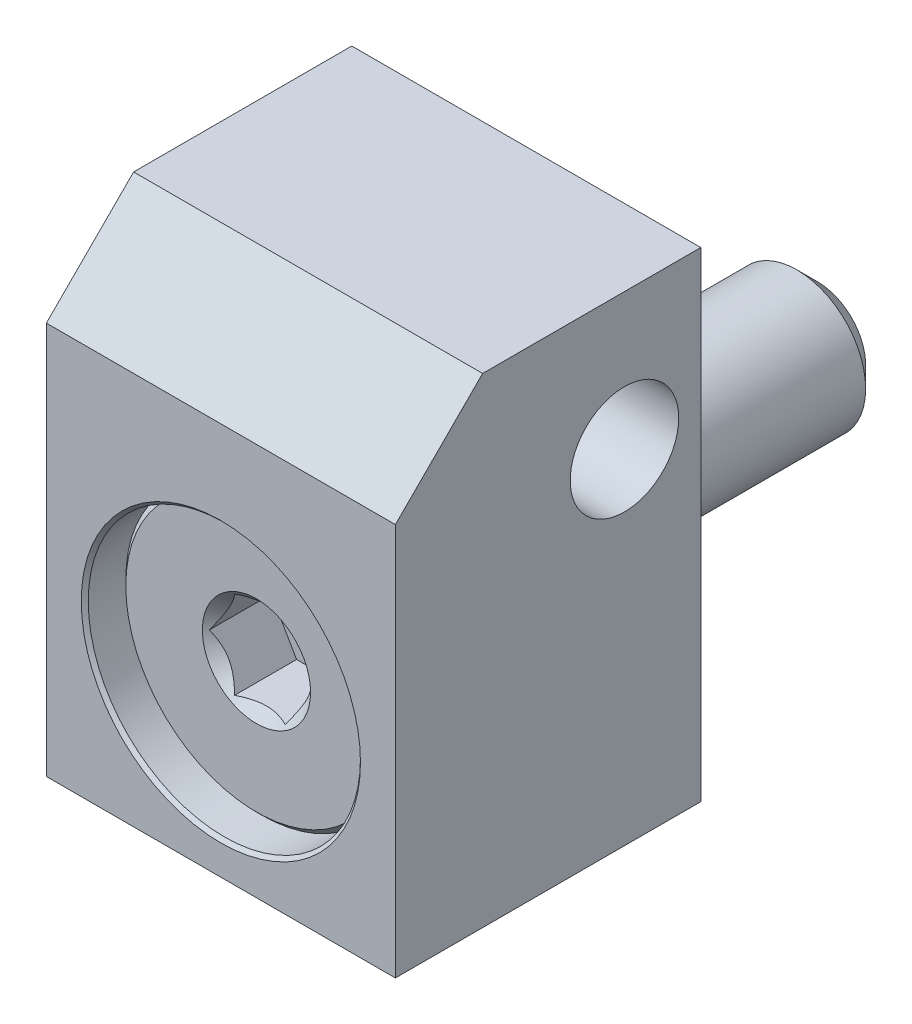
ISO-10303-21;
HEADER;
FILE_DESCRIPTION(('STEP AP214'),'2;1');
FILE_NAME('part.step','',(''),(''),'','','');
FILE_SCHEMA(('AUTOMOTIVE_DESIGN { 1 0 10303 214 1 1 1 1 }'));
ENDSEC;
DATA;
#1=APPLICATION_CONTEXT('core data for automotive mechanical design processes');
#2=APPLICATION_PROTOCOL_DEFINITION('international standard','automotive_design',2000,#1);
#3=PRODUCT_CONTEXT('',#1,'mechanical');
#4=PRODUCT('Part','Part','',(#3));
#5=PRODUCT_RELATED_PRODUCT_CATEGORY('part','',(#4));
#6=PRODUCT_DEFINITION_FORMATION('','',#4);
#7=PRODUCT_DEFINITION_CONTEXT('part definition',#1,'design');
#8=PRODUCT_DEFINITION('design','',#6,#7);
#9=PRODUCT_DEFINITION_SHAPE('','',#8);
#10=(LENGTH_UNIT() NAMED_UNIT(*) SI_UNIT(.MILLI.,.METRE.));
#11=(NAMED_UNIT(*) PLANE_ANGLE_UNIT() SI_UNIT($,.RADIAN.));
#12=(NAMED_UNIT(*) SI_UNIT($,.STERADIAN.) SOLID_ANGLE_UNIT());
#13=UNCERTAINTY_MEASURE_WITH_UNIT(LENGTH_MEASURE(1.E-05),#10,'distance_accuracy_value','');
#14=(GEOMETRIC_REPRESENTATION_CONTEXT(3) GLOBAL_UNCERTAINTY_ASSIGNED_CONTEXT((#13)) GLOBAL_UNIT_ASSIGNED_CONTEXT((#10,
#11,#12)) REPRESENTATION_CONTEXT('',''));
#15=CARTESIAN_POINT('',(0.,0.,0.));
#16=DIRECTION('',(0.,0.,1.));
#17=DIRECTION('',(1.,0.,0.));
#18=AXIS2_PLACEMENT_3D('',#15,#16,#17);
#19=CARTESIAN_POINT('',(1.8440856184,-3.19405,16.2683675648));
#20=DIRECTION('',(0.866025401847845,-0.500000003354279,0.));
#21=DIRECTION('',(0.500000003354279,0.866025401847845,0.));
#22=AXIS2_PLACEMENT_3D('',#19,#20,#21);
#23=PLANE('',#22);
#24=CARTESIAN_POINT('',(3.6881712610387,-1.7484970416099E-09,20.7820388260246));
#25=CARTESIAN_POINT('',(3.62478914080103,-0.109781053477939,20.7187175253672));
#26=CARTESIAN_POINT('',(3.56034726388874,-0.221397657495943,20.6591158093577));
#27=CARTESIAN_POINT('',(3.42894366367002,-0.448995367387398,20.5499876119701));
#28=CARTESIAN_POINT('',(3.36196945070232,-0.564998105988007,20.5005218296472));
#29=CARTESIAN_POINT('',(3.22691924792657,-0.798911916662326,20.4157866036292));
#30=CARTESIAN_POINT('',(3.15887763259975,-0.916763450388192,20.3803042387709));
#31=CARTESIAN_POINT('',(3.02129683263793,-1.15506038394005,20.325636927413));
#32=CARTESIAN_POINT('',(2.95176184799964,-1.27549850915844,20.3064111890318));
#33=CARTESIAN_POINT('',(2.83191525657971,-1.48307889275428,20.2890640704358));
#34=CARTESIAN_POINT('',(2.78175832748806,-1.56995324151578,20.2864968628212));
#35=CARTESIAN_POINT('',(2.68152611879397,-1.74356051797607,20.2908274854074));
#36=CARTESIAN_POINT('',(2.63145087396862,-1.83029338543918,20.2977286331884));
#37=CARTESIAN_POINT('',(2.53177486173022,-2.00293730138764,20.3206019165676));
#38=CARTESIAN_POINT('',(2.48217468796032,-2.08884732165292,20.3365841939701));
#39=CARTESIAN_POINT('',(2.38382622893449,-2.25919184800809,20.3767474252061));
#40=CARTESIAN_POINT('',(2.335077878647,-2.34362646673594,20.4009277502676));
#41=CARTESIAN_POINT('',(2.24854692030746,-2.49350248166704,20.4506707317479));
#42=CARTESIAN_POINT('',(2.21057255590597,-2.55927600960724,20.4749243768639));
#43=CARTESIAN_POINT('',(2.13530537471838,-2.68964259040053,20.5273394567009));
#44=CARTESIAN_POINT('',(2.09801257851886,-2.75423560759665,20.5555010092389));
#45=CARTESIAN_POINT('',(2.0242260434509,-2.88203763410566,20.6151008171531));
#46=CARTESIAN_POINT('',(1.98773020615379,-2.94525027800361,20.646528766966));
#47=CARTESIAN_POINT('',(1.91541422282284,-3.07050523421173,20.7122488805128));
#48=CARTESIAN_POINT('',(1.87959367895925,-3.13254823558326,20.7465392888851));
#49=CARTESIAN_POINT('',(1.84408561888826,-3.19404999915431,20.7820388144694));
#50=B_SPLINE_CURVE_WITH_KNOTS('',3,(#24,#25,#26,#27,#28,#29,#30,#31,#32,#33,#34,#35,#36,#37,#38,
#39,#40,#41,#42,#43,#44,#45,#46,#47,#48,#49),.UNSPECIFIED.,.F.,.F.,(4,2,2,2,2,2,2,2,2,2,2,2,4),
(0.,0.425392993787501,0.853263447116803,1.27434076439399,1.69435833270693,1.99497286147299,
2.2956927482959,2.59674914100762,2.89778244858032,3.1368524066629,3.37592957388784,
3.61427411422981,3.85247355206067),.UNSPECIFIED.);
#51=CARTESIAN_POINT('',(3.68817126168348,-8.94631599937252E-10,20.7820388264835));
#52=VERTEX_POINT('',#51);
#53=CARTESIAN_POINT('',(1.84408561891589,-3.19405,20.7820388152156));
#54=VERTEX_POINT('',#53);
#55=EDGE_CURVE('E230',#52,#54,#50,.T.);
#56=ORIENTED_EDGE('',*,*,#55,.F.);
#57=DIRECTION('',(0.,0.,1.));
#58=VECTOR('',#57,1.);
#59=CARTESIAN_POINT('',(3.6881712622,0.,18.5387442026));
#60=LINE('',#59,#58);
#61=CARTESIAN_POINT('',(3.6881712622,0.,16.2683675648));
#62=VERTEX_POINT('',#61);
#63=EDGE_CURVE('E160',#62,#52,#60,.T.);
#64=ORIENTED_EDGE('',*,*,#63,.F.);
#65=DIRECTION('',(0.50000000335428,0.866025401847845,0.));
#66=VECTOR('',#65,1.);
#67=CARTESIAN_POINT('',(2.7661284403,-1.597025,16.2683675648));
#68=LINE('',#67,#66);
#69=CARTESIAN_POINT('',(1.8440856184,-3.19405,16.2683675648));
#70=VERTEX_POINT('',#69);
#71=EDGE_CURVE('E156',#70,#62,#68,.T.);
#72=ORIENTED_EDGE('',*,*,#71,.F.);
#73=DIRECTION('',(0.,0.,1.));
#74=VECTOR('',#73,1.);
#75=CARTESIAN_POINT('',(1.8440856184,-3.19405,18.5387442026));
#76=LINE('',#75,#74);
#77=EDGE_CURVE('E159',#70,#54,#76,.T.);
#78=ORIENTED_EDGE('',*,*,#77,.T.);
#79=EDGE_LOOP('',(#56,#64,#72,#78));
#80=FACE_BOUND('',#79,.T.);
#81=ADVANCED_FACE('F14',(#80),#23,.F.);
#82=CARTESIAN_POINT('',(-1.8440856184,-3.19405,16.2683675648));
#83=DIRECTION('',(0.,-1.,0.));
#84=DIRECTION('',(1.,0.,0.));
#85=AXIS2_PLACEMENT_3D('',#82,#83,#84);
#86=PLANE('',#85);
#87=CARTESIAN_POINT('',(1.84408561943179,-3.19405,20.7820388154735));
#88=CARTESIAN_POINT('',(1.7173213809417,-3.19405,20.7187175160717));
#89=CARTESIAN_POINT('',(1.58843762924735,-3.19405,20.659115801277));
#90=CARTESIAN_POINT('',(1.32563043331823,-3.19405,20.549987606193));
#91=CARTESIAN_POINT('',(1.19168200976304,-3.19405,20.5005218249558));
#92=CARTESIAN_POINT('',(0.921581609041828,-3.19405,20.4157866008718));
#93=CARTESIAN_POINT('',(0.785498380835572,-3.19405,20.3803042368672));
#94=CARTESIAN_POINT('',(0.51033678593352,-3.19405,20.325636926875));
#95=CARTESIAN_POINT('',(0.371266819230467,-3.19405,20.306411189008));
#96=CARTESIAN_POINT('',(0.131573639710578,-3.19405,20.2890640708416));
#97=CARTESIAN_POINT('',(0.031259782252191,-3.19405,20.2864968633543));
#98=CARTESIAN_POINT('',(-0.169204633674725,-3.19405,20.2908274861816));
#99=CARTESIAN_POINT('',(-0.269355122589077,-3.19405,20.2977286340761));
#100=CARTESIAN_POINT('',(-0.468707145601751,-3.19405,20.3206019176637));
#101=CARTESIAN_POINT('',(-0.567907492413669,-3.19405,20.3365841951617));
#102=CARTESIAN_POINT('',(-0.764604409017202,-3.19405,20.3767474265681));
#103=CARTESIAN_POINT('',(-0.862101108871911,-3.19405,20.4009277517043));
#104=CARTESIAN_POINT('',(-1.03516302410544,-3.19405,20.450670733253));
#105=CARTESIAN_POINT('',(-1.11111175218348,-3.19405,20.4749243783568));
#106=CARTESIAN_POINT('',(-1.26164611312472,-3.19405,20.5273394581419));
#107=CARTESIAN_POINT('',(-1.3362317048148,-3.19405,20.5555010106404));
#108=CARTESIAN_POINT('',(-1.48380477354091,-3.19405,20.6151008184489));
#109=CARTESIAN_POINT('',(-1.55679644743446,-3.19405,20.6465287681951));
#110=CARTESIAN_POINT('',(-1.70142841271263,-3.19405,20.7122488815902));
#111=CARTESIAN_POINT('',(-1.77306949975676,-3.19405,20.7465392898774));
#112=CARTESIAN_POINT('',(-1.84408561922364,-3.19405,20.7820388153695));
#113=B_SPLINE_CURVE_WITH_KNOTS('',3,(#87,#88,#89,#90,#91,#92,#93,#94,#95,#96,#97,#98,#99,#100,
#101,#102,#103,#104,#105,#106,#107,#108,#109,#110,#111,#112),.UNSPECIFIED.,.F.,.F.,(4,2,2,2,2,2,
2,2,2,2,2,2,4),(0.,0.425392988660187,0.85326343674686,1.27434074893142,1.69435831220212,
1.99497284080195,2.29569272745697,2.59674912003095,2.89778242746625,3.13685238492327,
3.3759295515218,3.61427409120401,3.85247352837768),.UNSPECIFIED.);
#114=CARTESIAN_POINT('',(-1.84408561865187,-3.19404999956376,20.7820388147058));
#115=VERTEX_POINT('',#114);
#116=EDGE_CURVE('E197',#54,#115,#113,.T.);
#117=ORIENTED_EDGE('',*,*,#116,.F.);
#118=ORIENTED_EDGE('',*,*,#77,.F.);
#119=DIRECTION('',(1.,0.,0.));
#120=VECTOR('',#119,1.);
#121=CARTESIAN_POINT('',(0.,-3.19405,16.2683675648));
#122=LINE('',#121,#120);
#123=CARTESIAN_POINT('',(-1.8440856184,-3.19405,16.2683675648));
#124=VERTEX_POINT('',#123);
#125=EDGE_CURVE('E161',#124,#70,#122,.T.);
#126=ORIENTED_EDGE('',*,*,#125,.F.);
#127=DIRECTION('',(0.,0.,-1.));
#128=VECTOR('',#127,1.);
#129=CARTESIAN_POINT('',(-1.8440856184,-3.19405,18.5387442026));
#130=LINE('',#129,#128);
#131=EDGE_CURVE('E164',#115,#124,#130,.T.);
#132=ORIENTED_EDGE('',*,*,#131,.F.);
#133=EDGE_LOOP('',(#117,#118,#126,#132));
#134=FACE_BOUND('',#133,.T.);
#135=ADVANCED_FACE('F272',(#134),#86,.F.);
#136=CARTESIAN_POINT('',(-3.6881712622,0.,16.2683675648));
#137=DIRECTION('',(-0.866025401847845,-0.500000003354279,0.));
#138=DIRECTION('',(0.500000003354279,-0.866025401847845,0.));
#139=AXIS2_PLACEMENT_3D('',#136,#137,#138);
#140=PLANE('',#139);
#141=CARTESIAN_POINT('',(-1.84408561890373,-3.19404999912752,20.782038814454));
#142=CARTESIAN_POINT('',(-1.90746773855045,-3.08426894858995,20.7187175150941));
#143=CARTESIAN_POINT('',(-1.97190961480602,-2.97265234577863,20.6591158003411));
#144=CARTESIAN_POINT('',(-2.10331321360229,-2.74505463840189,20.5499876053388));
#145=CARTESIAN_POINT('',(-2.17028742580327,-2.62905190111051,20.5005218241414));
#146=CARTESIAN_POINT('',(-2.3053376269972,-2.39513809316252,20.4157866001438));
#147=CARTESIAN_POINT('',(-2.37337924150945,-2.27728656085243,20.3803042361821));
#148=CARTESIAN_POINT('',(-2.51096003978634,-2.03898963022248,20.3256369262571));
#149=CARTESIAN_POINT('',(-2.58049502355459,-1.91855150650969,20.3064111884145));
#150=CARTESIAN_POINT('',(-2.7003416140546,-1.71097112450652,20.2890640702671));
#151=CARTESIAN_POINT('',(-2.75049854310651,-1.62409677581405,20.2864968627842));
#152=CARTESIAN_POINT('',(-2.85073075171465,-1.45048949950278,20.2908274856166));
#153=CARTESIAN_POINT('',(-2.90080599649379,-1.36375663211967,20.297728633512));
#154=CARTESIAN_POINT('',(-3.00048200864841,-1.19111271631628,20.3206019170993));
#155=CARTESIAN_POINT('',(-3.0500821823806,-1.10520269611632,20.3365841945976));
#156=CARTESIAN_POINT('',(-3.14843064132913,-0.934858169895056,20.3767474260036));
#157=CARTESIAN_POINT('',(-3.19717899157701,-0.850423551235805,20.4009277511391));
#158=CARTESIAN_POINT('',(-3.28370995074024,-0.700547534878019,20.4506707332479));
#159=CARTESIAN_POINT('',(-3.32168431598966,-0.634774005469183,20.4749243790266));
#160=CARTESIAN_POINT('',(-3.39695149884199,-0.504407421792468,20.5273394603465));
#161=CARTESIAN_POINT('',(-3.43424429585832,-0.439814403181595,20.5555010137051));
#162=CARTESIAN_POINT('',(-3.50803083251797,-0.312012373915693,20.6151008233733));
#163=CARTESIAN_POINT('',(-3.54452667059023,-0.248799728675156,20.6465287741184));
#164=CARTESIAN_POINT('',(-3.61684265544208,-0.123544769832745,20.7122488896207));
#165=CARTESIAN_POINT('',(-3.65266320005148,-0.0615017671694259,20.7465392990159));
#166=CARTESIAN_POINT('',(-3.68817126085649,-2.32702668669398E-09,20.7820388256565));
#167=B_SPLINE_CURVE_WITH_KNOTS('',3,(#141,#142,#143,#144,#145,#146,#147,#148,#149,#150,#151,
#152,#153,#154,#155,#156,#157,#158,#159,#160,#161,#162,#163,#164,#165,#166),.UNSPECIFIED.,.F.,
.F.,(4,2,2,2,2,2,2,2,2,2,2,2,4),(0.,0.425392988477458,0.853263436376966,1.27434074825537,
1.69435831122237,1.99497283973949,2.29569272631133,2.59674911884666,2.89778242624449,
3.13685238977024,3.37592956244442,3.61427410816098,3.85247355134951),.UNSPECIFIED.);
#168=CARTESIAN_POINT('',(-3.68817126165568,9.42790922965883E-10,20.7820388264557));
#169=VERTEX_POINT('',#168);
#170=EDGE_CURVE('E188',#115,#169,#167,.T.);
#171=ORIENTED_EDGE('',*,*,#170,.F.);
#172=ORIENTED_EDGE('',*,*,#131,.T.);
#173=DIRECTION('',(0.50000000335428,-0.866025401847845,0.));
#174=VECTOR('',#173,1.);
#175=CARTESIAN_POINT('',(-2.7661284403,-1.597025,16.2683675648));
#176=LINE('',#175,#174);
#177=CARTESIAN_POINT('',(-3.6881712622,0.,16.2683675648));
#178=VERTEX_POINT('',#177);
#179=EDGE_CURVE('E165',#178,#124,#176,.T.);
#180=ORIENTED_EDGE('',*,*,#179,.F.);
#181=DIRECTION('',(0.,0.,-1.));
#182=VECTOR('',#181,1.);
#183=CARTESIAN_POINT('',(-3.6881712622,0.,18.5387442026));
#184=LINE('',#183,#182);
#185=EDGE_CURVE('E168',#169,#178,#184,.T.);
#186=ORIENTED_EDGE('',*,*,#185,.F.);
#187=EDGE_LOOP('',(#171,#172,#180,#186));
#188=FACE_BOUND('',#187,.T.);
#189=ADVANCED_FACE('F204',(#188),#140,.F.);
#190=CARTESIAN_POINT('',(-1.8440856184,3.19405,16.2683675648));
#191=DIRECTION('',(-0.866025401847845,0.500000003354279,0.));
#192=DIRECTION('',(-0.500000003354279,-0.866025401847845,0.));
#193=AXIS2_PLACEMENT_3D('',#190,#191,#192);
#194=PLANE('',#193);
#195=CARTESIAN_POINT('',(-3.68817125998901,1.52885915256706E-09,20.7820388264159));
#196=CARTESIAN_POINT('',(-3.6247891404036,0.109781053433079,20.7187175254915));
#197=CARTESIAN_POINT('',(-3.56034726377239,0.221397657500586,20.6591158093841));
#198=CARTESIAN_POINT('',(-3.42894366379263,0.44899536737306,20.5499876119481));
#199=CARTESIAN_POINT('',(-3.36196945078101,0.564998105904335,20.5005218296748));
#200=CARTESIAN_POINT('',(-3.22691924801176,0.79891191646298,20.4157866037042));
#201=CARTESIAN_POINT('',(-3.15887763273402,0.916763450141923,20.3803042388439));
#202=CARTESIAN_POINT('',(-3.02129683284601,1.15506038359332,20.3256369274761));
#203=CARTESIAN_POINT('',(-2.95176184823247,1.27549850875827,20.3064111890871));
#204=CARTESIAN_POINT('',(-2.83191525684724,1.48307889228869,20.289064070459));
#205=CARTESIAN_POINT('',(-2.78175832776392,1.56995324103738,20.2864968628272));
#206=CARTESIAN_POINT('',(-2.68152611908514,1.74356051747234,20.290827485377));
#207=CARTESIAN_POINT('',(-2.63145087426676,1.83029338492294,20.2977286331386));
#208=CARTESIAN_POINT('',(-2.53177486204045,2.00293730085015,20.3206019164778));
#209=CARTESIAN_POINT('',(-2.48217468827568,2.08884732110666,20.3365841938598));
#210=CARTESIAN_POINT('',(-2.38382622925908,2.25919184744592,20.3767474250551));
#211=CARTESIAN_POINT('',(-2.3350778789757,2.34362646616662,20.4009277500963));
#212=CARTESIAN_POINT('',(-2.24854692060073,2.49350248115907,20.4506707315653));
#213=CARTESIAN_POINT('',(-2.21057255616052,2.55927600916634,20.4749243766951));
#214=CARTESIAN_POINT('',(-2.13530537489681,2.68964259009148,20.5273394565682));
#215=CARTESIAN_POINT('',(-2.09801257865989,2.75423560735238,20.5555010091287));
#216=CARTESIAN_POINT('',(-2.02422604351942,2.88203763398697,20.6151008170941));
#217=CARTESIAN_POINT('',(-1.98773020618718,2.94525027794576,20.6465287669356));
#218=CARTESIAN_POINT('',(-1.91541422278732,3.07050523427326,20.7122488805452));
#219=CARTESIAN_POINT('',(-1.87959367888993,3.13254823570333,20.7465392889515));
#220=CARTESIAN_POINT('',(-1.84408561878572,3.19404999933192,20.782038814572));
#221=B_SPLINE_CURVE_WITH_KNOTS('',3,(#195,#196,#197,#198,#199,#200,#201,#202,#203,#204,#205,
#206,#207,#208,#209,#210,#211,#212,#213,#214,#215,#216,#217,#218,#219,#220),.UNSPECIFIED.,.F.,
.F.,(4,2,2,2,2,2,2,2,2,2,2,2,4),(0.,0.425392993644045,0.853263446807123,1.27434076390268,
1.69435833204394,1.99497286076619,2.29569274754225,2.59674914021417,2.8977824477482,
3.13685240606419,3.37592957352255,3.61427411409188,3.85247355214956),.UNSPECIFIED.);
#222=CARTESIAN_POINT('',(-1.84408561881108,3.19405,20.7820388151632));
#223=VERTEX_POINT('',#222);
#224=EDGE_CURVE('E155',#169,#223,#221,.T.);
#225=ORIENTED_EDGE('',*,*,#224,.F.);
#226=ORIENTED_EDGE('',*,*,#185,.T.);
#227=DIRECTION('',(-0.50000000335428,-0.866025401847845,0.));
#228=VECTOR('',#227,1.);
#229=CARTESIAN_POINT('',(-2.7661284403,1.597025,16.2683675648));
#230=LINE('',#229,#228);
#231=CARTESIAN_POINT('',(-1.8440856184,3.19405,16.2683675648));
#232=VERTEX_POINT('',#231);
#233=EDGE_CURVE('E90',#232,#178,#230,.T.);
#234=ORIENTED_EDGE('',*,*,#233,.F.);
#235=DIRECTION('',(0.,0.,1.));
#236=VECTOR('',#235,1.);
#237=CARTESIAN_POINT('',(-1.8440856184,3.19405,18.5387442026));
#238=LINE('',#237,#236);
#239=EDGE_CURVE('E170',#232,#223,#238,.T.);
#240=ORIENTED_EDGE('',*,*,#239,.T.);
#241=EDGE_LOOP('',(#225,#226,#234,#240));
#242=FACE_BOUND('',#241,.T.);
#243=ADVANCED_FACE('F258',(#242),#194,.F.);
#244=CARTESIAN_POINT('',(1.8440856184,3.19405,16.2683675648));
#245=DIRECTION('',(0.,1.,0.));
#246=DIRECTION('',(-1.,0.,0.));
#247=AXIS2_PLACEMENT_3D('',#244,#245,#246);
#248=PLANE('',#247);
#249=CARTESIAN_POINT('',(-1.84408561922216,3.19405,20.7820388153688));
#250=CARTESIAN_POINT('',(-1.71732138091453,3.19405,20.7187175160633));
#251=CARTESIAN_POINT('',(-1.58843762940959,3.19405,20.6591158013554));
#252=CARTESIAN_POINT('',(-1.32563043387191,3.19405,20.5499876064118));
#253=CARTESIAN_POINT('',(-1.19168201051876,3.19405,20.5005218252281));
#254=CARTESIAN_POINT('',(-0.921581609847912,3.19405,20.4157866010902));
#255=CARTESIAN_POINT('',(-0.78549838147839,3.19405,20.3803042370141));
#256=CARTESIAN_POINT('',(-0.510336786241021,3.19405,20.325636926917));
#257=CARTESIAN_POINT('',(-0.37126681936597,3.19405,20.3064111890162));
#258=CARTESIAN_POINT('',(-0.131573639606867,3.19405,20.2890640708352));
#259=CARTESIAN_POINT('',(-0.0312597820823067,3.19405,20.2864968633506));
#260=CARTESIAN_POINT('',(0.169204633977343,3.19405,20.2908274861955));
#261=CARTESIAN_POINT('',(0.269355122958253,3.19405,20.2977286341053));
#262=CARTESIAN_POINT('',(0.468707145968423,3.19405,20.320601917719));
#263=CARTESIAN_POINT('',(0.567907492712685,3.19405,20.3365841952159));
#264=CARTESIAN_POINT('',(0.764604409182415,3.19405,20.3767474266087));
#265=CARTESIAN_POINT('',(0.862101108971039,3.19405,20.4009277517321));
#266=CARTESIAN_POINT('',(1.03516300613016,3.19405,20.450670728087));
#267=CARTESIAN_POINT('',(1.11111171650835,3.19405,20.4749243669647));
#268=CARTESIAN_POINT('',(1.26164604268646,3.19405,20.5273394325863));
#269=CARTESIAN_POINT('',(1.33623161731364,3.19405,20.5555009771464));
#270=CARTESIAN_POINT('',(1.4838046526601,3.19405,20.6151007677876));
#271=CARTESIAN_POINT('',(1.55679631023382,3.19405,20.6465287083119));
#272=CARTESIAN_POINT('',(1.70142824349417,3.19405,20.7122488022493));
#273=CARTESIAN_POINT('',(1.77306931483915,3.19405,20.7465392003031));
#274=CARTESIAN_POINT('',(1.84408541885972,3.19405,20.7820387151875));
#275=B_SPLINE_CURVE_WITH_KNOTS('',3,(#249,#250,#251,#252,#253,#254,#255,#256,#257,#258,#259,
#260,#261,#262,#263,#264,#265,#266,#267,#268,#269,#270,#271,#272,#273,#274),.UNSPECIFIED.,.F.,
.F.,(4,2,2,2,2,2,2,2,2,2,2,2,4),(0.,0.425392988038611,0.853263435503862,1.27434074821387,
1.6943583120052,1.99497284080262,2.29569272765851,2.59674912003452,2.89778242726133,
3.13685232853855,3.37592943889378,3.61427392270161,3.85247330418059),.UNSPECIFIED.);
#276=CARTESIAN_POINT('',(1.84408560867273,3.19405001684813,20.782038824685));
#277=VERTEX_POINT('',#276);
#278=EDGE_CURVE('E57',#223,#277,#275,.T.);
#279=ORIENTED_EDGE('',*,*,#278,.F.);
#280=ORIENTED_EDGE('',*,*,#239,.F.);
#281=DIRECTION('',(-1.,0.,0.));
#282=VECTOR('',#281,1.);
#283=CARTESIAN_POINT('',(0.,3.19405,16.2683675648));
#284=LINE('',#283,#282);
#285=CARTESIAN_POINT('',(1.8440856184,3.19405,16.2683675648));
#286=VERTEX_POINT('',#285);
#287=EDGE_CURVE('E94',#286,#232,#284,.T.);
#288=ORIENTED_EDGE('',*,*,#287,.F.);
#289=DIRECTION('',(0.,0.,1.));
#290=VECTOR('',#289,1.);
#291=CARTESIAN_POINT('',(1.8440856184,3.19405,18.5387442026));
#292=LINE('',#291,#290);
#293=EDGE_CURVE('E172',#286,#277,#292,.T.);
#294=ORIENTED_EDGE('',*,*,#293,.T.);
#295=EDGE_LOOP('',(#279,#280,#288,#294));
#296=FACE_BOUND('',#295,.T.);
#297=ADVANCED_FACE('F245',(#296),#248,.F.);
#298=CARTESIAN_POINT('',(3.6881712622,0.,16.2683675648));
#299=DIRECTION('',(0.866025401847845,0.500000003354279,0.));
#300=DIRECTION('',(-0.500000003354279,0.866025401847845,0.));
#301=AXIS2_PLACEMENT_3D('',#298,#299,#300);
#302=PLANE('',#301);
#303=CARTESIAN_POINT('',(1.84408553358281,3.19404997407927,20.7820388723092));
#304=CARTESIAN_POINT('',(1.90746769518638,3.08426896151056,20.7187175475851));
#305=CARTESIAN_POINT('',(1.97190958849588,2.97265237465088,20.6591158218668));
#306=CARTESIAN_POINT('',(2.10331319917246,2.74505468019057,20.5499876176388));
#307=CARTESIAN_POINT('',(2.17028740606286,2.62905193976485,20.5005218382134));
#308=CARTESIAN_POINT('',(2.30533760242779,2.3951381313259,20.4157866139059));
#309=CARTESIAN_POINT('',(2.37337921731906,2.27728660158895,20.3803042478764));
#310=CARTESIAN_POINT('',(2.51096001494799,2.03898967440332,20.3256369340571));
#311=CARTESIAN_POINT('',(2.58049499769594,1.91855155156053,20.3064111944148));
#312=CARTESIAN_POINT('',(2.7003415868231,1.71097117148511,20.2890640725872));
#313=CARTESIAN_POINT('',(2.75049851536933,1.62409682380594,20.2864968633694));
#314=CARTESIAN_POINT('',(2.85073072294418,1.45048954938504,20.2908274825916));
#315=CARTESIAN_POINT('',(2.9008059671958,1.36375668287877,20.2977286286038));
#316=CARTESIAN_POINT('',(3.00048197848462,1.19111276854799,20.3206019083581));
#317=CARTESIAN_POINT('',(3.05008215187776,1.10520274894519,20.3365841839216));
#318=CARTESIAN_POINT('',(3.14843061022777,0.934858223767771,20.3767474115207));
#319=CARTESIAN_POINT('',(3.19717896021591,0.850423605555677,20.4009277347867));
#320=CARTESIAN_POINT('',(3.28370992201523,0.700547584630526,20.4506707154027));
#321=CARTESIAN_POINT('',(3.3216842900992,0.634774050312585,20.474924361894));
#322=CARTESIAN_POINT('',(3.39695147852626,0.504407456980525,20.5273394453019));
#323=CARTESIAN_POINT('',(3.43424427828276,0.439814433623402,20.5555010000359));
#324=CARTESIAN_POINT('',(3.50803082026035,0.312012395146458,20.6151008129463));
#325=CARTESIAN_POINT('',(3.5445266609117,0.24879974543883,20.6465287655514));
#326=CARTESIAN_POINT('',(3.61684265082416,0.123544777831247,20.7122488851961));
#327=CARTESIAN_POINT('',(3.6526631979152,0.0615017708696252,20.7465392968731));
#328=CARTESIAN_POINT('',(3.68817126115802,1.8047641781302E-09,20.782038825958));
#329=B_SPLINE_CURVE_WITH_KNOTS('',3,(#303,#304,#305,#306,#307,#308,#309,#310,#311,#312,#313,
#314,#315,#316,#317,#318,#319,#320,#321,#322,#323,#324,#325,#326,#327,#328),.UNSPECIFIED.,.F.,
.F.,(4,2,2,2,2,2,2,2,2,2,2,2,4),(0.,0.425392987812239,0.853263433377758,1.27434074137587,
1.6943583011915,1.99497282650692,2.29569270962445,2.59674909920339,2.89778240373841,
3.1368523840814,3.37592957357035,3.61427413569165,3.85247359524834),.UNSPECIFIED.);
#330=EDGE_CURVE('E50',#277,#52,#329,.T.);
#331=ORIENTED_EDGE('',*,*,#330,.F.);
#332=ORIENTED_EDGE('',*,*,#293,.F.);
#333=DIRECTION('',(-0.50000000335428,0.866025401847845,0.));
#334=VECTOR('',#333,1.);
#335=CARTESIAN_POINT('',(2.7661284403,1.597025,16.2683675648));
#336=LINE('',#335,#334);
#337=EDGE_CURVE('E173',#62,#286,#336,.T.);
#338=ORIENTED_EDGE('',*,*,#337,.F.);
#339=ORIENTED_EDGE('',*,*,#63,.T.);
#340=EDGE_LOOP('',(#331,#332,#338,#339));
#341=FACE_BOUND('',#340,.T.);
#342=ADVANCED_FACE('F241',(#341),#302,.F.);
#343=CARTESIAN_POINT('',(-3.6881712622,-3.19405,16.2683675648));
#344=DIRECTION('',(0.,0.,1.));
#345=DIRECTION('',(1.,0.,0.));
#346=AXIS2_PLACEMENT_3D('',#343,#344,#345);
#347=PLANE('',#346);
#348=ORIENTED_EDGE('',*,*,#179,.T.);
#349=ORIENTED_EDGE('',*,*,#125,.T.);
#350=ORIENTED_EDGE('',*,*,#71,.T.);
#351=ORIENTED_EDGE('',*,*,#337,.T.);
#352=ORIENTED_EDGE('',*,*,#287,.T.);
#353=ORIENTED_EDGE('',*,*,#233,.T.);
#354=EDGE_LOOP('',(#348,#349,#350,#351,#352,#353));
#355=FACE_BOUND('',#354,.T.);
#356=ADVANCED_FACE('F244',(#355),#347,.T.);
#357=CARTESIAN_POINT('',(-9.62387712,-9.62387712,21.0308675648));
#358=DIRECTION('',(0.,0.,1.));
#359=DIRECTION('',(1.,0.,0.));
#360=AXIS2_PLACEMENT_3D('',#357,#358,#359);
#361=PLANE('',#360);
#362=CARTESIAN_POINT('',(0.,0.,21.0308675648));
#363=DIRECTION('',(0.,0.,1.));
#364=DIRECTION('',(1.,0.,0.));
#365=AXIS2_PLACEMENT_3D('',#362,#363,#364);
#366=CIRCLE('',#365,3.937);
#367=CARTESIAN_POINT('',(3.937,0.,21.0308675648));
#368=VERTEX_POINT('',#367);
#369=EDGE_CURVE('E29',#368,#368,#366,.T.);
#370=ORIENTED_EDGE('',*,*,#369,.F.);
#371=EDGE_LOOP('',(#370));
#372=FACE_BOUND('',#371,.T.);
#373=CARTESIAN_POINT('',(0.,0.,21.0308675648));
#374=DIRECTION('',(0.,0.,-1.));
#375=DIRECTION('',(-1.,0.,0.));
#376=AXIS2_PLACEMENT_3D('',#373,#374,#375);
#377=CIRCLE('',#376,9.50976);
#378=CARTESIAN_POINT('',(-9.50976,0.,21.0308675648));
#379=VERTEX_POINT('',#378);
#380=EDGE_CURVE('E176',#379,#379,#377,.F.);
#381=ORIENTED_EDGE('',*,*,#380,.T.);
#382=EDGE_LOOP('',(#381));
#383=FACE_BOUND('',#382,.T.);
#384=ADVANCED_FACE('F215',(#372,#383),#361,.T.);
#385=CARTESIAN_POINT('',(0.,0.,21.0308675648));
#386=DIRECTION('',(0.,0.,-1.));
#387=DIRECTION('',(-1.,0.,0.));
#388=AXIS2_PLACEMENT_3D('',#385,#386,#387);
#389=CONICAL_SURFACE('',#388,9.50976,0.785398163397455);
#390=ORIENTED_EDGE('',*,*,#380,.F.);
#391=EDGE_LOOP('',(#390));
#392=FACE_BOUND('',#391,.T.);
#393=CARTESIAN_POINT('',(0.,0.,20.6346275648));
#394=DIRECTION('',(0.,0.,-1.));
#395=DIRECTION('',(-1.,0.,0.));
#396=AXIS2_PLACEMENT_3D('',#393,#394,#395);
#397=CIRCLE('',#396,9.906);
#398=CARTESIAN_POINT('',(-9.906,0.,20.6346275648));
#399=VERTEX_POINT('',#398);
#400=EDGE_CURVE('E334',#399,#399,#397,.T.);
#401=ORIENTED_EDGE('',*,*,#400,.F.);
#402=EDGE_LOOP('',(#401));
#403=FACE_BOUND('',#402,.T.);
#404=ADVANCED_FACE('F254',(#392,#403),#389,.T.);
#405=CARTESIAN_POINT('',(0.,0.,23.368));
#406=DIRECTION('',(0.,0.,-1.));
#407=DIRECTION('',(-1.,0.,0.));
#408=AXIS2_PLACEMENT_3D('',#405,#406,#407);
#409=CYLINDRICAL_SURFACE('',#408,9.906);
#410=ORIENTED_EDGE('',*,*,#400,.T.);
#411=EDGE_LOOP('',(#410));
#412=FACE_BOUND('',#411,.T.);
#413=CARTESIAN_POINT('',(0.,0.,23.368));
#414=DIRECTION('',(0.,0.,1.));
#415=DIRECTION('',(1.,0.,0.));
#416=AXIS2_PLACEMENT_3D('',#413,#414,#415);
#417=CIRCLE('',#416,9.906);
#418=CARTESIAN_POINT('',(9.906,0.,23.368));
#419=VERTEX_POINT('',#418);
#420=EDGE_CURVE('E335',#419,#419,#417,.F.);
#421=ORIENTED_EDGE('',*,*,#420,.F.);
#422=EDGE_LOOP('',(#421));
#423=FACE_BOUND('',#422,.T.);
#424=ADVANCED_FACE('F320',(#412,#423),#409,.F.);
#425=CARTESIAN_POINT('',(0.,0.,23.368));
#426=DIRECTION('',(0.,0.,1.));
#427=DIRECTION('',(1.,0.,0.));
#428=AXIS2_PLACEMENT_3D('',#425,#426,#427);
#429=CONICAL_SURFACE('',#428,9.906,0.785398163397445);
#430=CARTESIAN_POINT('',(0.,0.,23.622));
#431=DIRECTION('',(0.,0.,1.));
#432=DIRECTION('',(1.,0.,0.));
#433=AXIS2_PLACEMENT_3D('',#430,#431,#432);
#434=CIRCLE('',#433,10.16);
#435=CARTESIAN_POINT('',(10.16,0.,23.622));
#436=VERTEX_POINT('',#435);
#437=EDGE_CURVE('E338',#436,#436,#434,.T.);
#438=ORIENTED_EDGE('',*,*,#437,.T.);
#439=EDGE_LOOP('',(#438));
#440=FACE_BOUND('',#439,.T.);
#441=ORIENTED_EDGE('',*,*,#420,.T.);
#442=EDGE_LOOP('',(#441));
#443=FACE_BOUND('',#442,.T.);
#444=ADVANCED_FACE('F316',(#440,#443),#429,.F.);
#445=CARTESIAN_POINT('',(-7.968488,-7.968488,0.));
#446=DIRECTION('',(0.,0.,1.));
#447=DIRECTION('',(1.,0.,0.));
#448=AXIS2_PLACEMENT_3D('',#445,#446,#447);
#449=PLANE('',#448);
#450=CARTESIAN_POINT('',(0.,0.,0.));
#451=DIRECTION('',(0.,0.,1.));
#452=DIRECTION('',(1.,0.,0.));
#453=AXIS2_PLACEMENT_3D('',#450,#451,#452);
#454=CIRCLE('',#453,5.);
#455=CARTESIAN_POINT('',(5.,0.,0.));
#456=VERTEX_POINT('',#455);
#457=EDGE_CURVE('E187',#456,#456,#454,.F.);
#458=ORIENTED_EDGE('',*,*,#457,.F.);
#459=EDGE_LOOP('',(#458));
#460=FACE_BOUND('',#459,.T.);
#461=CARTESIAN_POINT('',(0.,0.,0.));
#462=DIRECTION('',(0.,0.,-1.));
#463=DIRECTION('',(-1.,0.,0.));
#464=AXIS2_PLACEMENT_3D('',#461,#462,#463);
#465=CIRCLE('',#464,7.874);
#466=CARTESIAN_POINT('',(-7.874,0.,0.));
#467=VERTEX_POINT('',#466);
#468=EDGE_CURVE('E345',#467,#467,#465,.F.);
#469=ORIENTED_EDGE('',*,*,#468,.F.);
#470=EDGE_LOOP('',(#469));
#471=FACE_BOUND('',#470,.T.);
#472=ADVANCED_FACE('F312',(#460,#471),#449,.F.);
#473=CARTESIAN_POINT('',(0.,0.,1.397));
#474=DIRECTION('',(0.,0.,-1.));
#475=DIRECTION('',(-1.,0.,0.));
#476=AXIS2_PLACEMENT_3D('',#473,#474,#475);
#477=CYLINDRICAL_SURFACE('',#476,7.874);
#478=CARTESIAN_POINT('',(0.,0.,1.397));
#479=DIRECTION('',(0.,0.,-1.));
#480=DIRECTION('',(-1.,0.,0.));
#481=AXIS2_PLACEMENT_3D('',#478,#479,#480);
#482=CIRCLE('',#481,7.874);
#483=CARTESIAN_POINT('',(-7.874,0.,1.397));
#484=VERTEX_POINT('',#483);
#485=EDGE_CURVE('E348',#484,#484,#482,.F.);
#486=ORIENTED_EDGE('',*,*,#485,.F.);
#487=EDGE_LOOP('',(#486));
#488=FACE_BOUND('',#487,.T.);
#489=ORIENTED_EDGE('',*,*,#468,.T.);
#490=EDGE_LOOP('',(#489));
#491=FACE_BOUND('',#490,.T.);
#492=ADVANCED_FACE('F308',(#488,#491),#477,.T.);
#493=CARTESIAN_POINT('',(-12.7,-12.319,1.397));
#494=DIRECTION('',(1.,0.,0.));
#495=DIRECTION('',(0.,1.,0.));
#496=AXIS2_PLACEMENT_3D('',#493,#494,#495);
#497=PLANE('',#496);
#498=CARTESIAN_POINT('',(-12.7,12.66825,6.95325000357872));
#499=DIRECTION('',(1.,0.,0.));
#500=DIRECTION('',(0.,0.,-1.));
#501=AXIS2_PLACEMENT_3D('',#498,#499,#500);
#502=CIRCLE('',#501,3.95);
#503=CARTESIAN_POINT('',(-12.7,12.66825,3.00325000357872));
#504=VERTEX_POINT('',#503);
#505=EDGE_CURVE('E183',#504,#504,#502,.T.);
#506=ORIENTED_EDGE('',*,*,#505,.T.);
#507=EDGE_LOOP('',(#506));
#508=FACE_BOUND('',#507,.T.);
#509=DIRECTION('',(0.,1.,0.));
#510=VECTOR('',#509,1.);
#511=CARTESIAN_POINT('',(-12.7,5.1435,1.397));
#512=LINE('',#511,#510);
#513=CARTESIAN_POINT('',(-12.7,-12.319,1.397));
#514=VERTEX_POINT('',#513);
#515=CARTESIAN_POINT('',(-12.7,22.606,1.397));
#516=VERTEX_POINT('',#515);
#517=EDGE_CURVE('E102',#514,#516,#512,.T.);
#518=ORIENTED_EDGE('',*,*,#517,.F.);
#519=DIRECTION('',(0.,0.,1.));
#520=VECTOR('',#519,1.);
#521=CARTESIAN_POINT('',(-12.7,-12.319,12.5095));
#522=LINE('',#521,#520);
#523=CARTESIAN_POINT('',(-12.7,-12.319,23.622));
#524=VERTEX_POINT('',#523);
#525=EDGE_CURVE('E351',#514,#524,#522,.T.);
#526=ORIENTED_EDGE('',*,*,#525,.T.);
#527=DIRECTION('',(0.,-1.,0.));
#528=VECTOR('',#527,1.);
#529=CARTESIAN_POINT('',(-12.7,5.1435,23.622));
#530=LINE('',#529,#528);
#531=CARTESIAN_POINT('',(-12.7,16.256,23.622));
#532=VERTEX_POINT('',#531);
#533=EDGE_CURVE('E353',#532,#524,#530,.T.);
#534=ORIENTED_EDGE('',*,*,#533,.F.);
#535=DIRECTION('',(0.,0.707106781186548,-0.707106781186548));
#536=VECTOR('',#535,1.);
#537=CARTESIAN_POINT('',(-12.7,16.256,23.622));
#538=LINE('',#537,#536);
#539=CARTESIAN_POINT('',(-12.7,22.606,17.272));
#540=VERTEX_POINT('',#539);
#541=EDGE_CURVE('E142',#540,#532,#538,.F.);
#542=ORIENTED_EDGE('',*,*,#541,.F.);
#543=DIRECTION('',(0.,0.,1.));
#544=VECTOR('',#543,1.);
#545=CARTESIAN_POINT('',(-12.7,22.606,12.5095));
#546=LINE('',#545,#544);
#547=EDGE_CURVE('E356',#516,#540,#546,.T.);
#548=ORIENTED_EDGE('',*,*,#547,.F.);
#549=EDGE_LOOP('',(#518,#526,#534,#542,#548));
#550=FACE_BOUND('',#549,.T.);
#551=CARTESIAN_POINT('',(-12.7,16.637,6.98500000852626));
#552=VERTEX_POINT('',#551);
#553=VERTEX_LOOP('',#552);
#554=FACE_BOUND('',#553,.T.);
#555=CARTESIAN_POINT('',(-12.7,8.6995,6.9850000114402));
#556=VERTEX_POINT('',#555);
#557=VERTEX_LOOP('',#556);
#558=FACE_BOUND('',#557,.T.);
#559=ADVANCED_FACE('F304',(#508,#550,#554,#558),#497,.F.);
#560=CARTESIAN_POINT('',(12.7,-12.319,1.397));
#561=DIRECTION('',(0.,1.,0.));
#562=DIRECTION('',(-1.,0.,0.));
#563=AXIS2_PLACEMENT_3D('',#560,#561,#562);
#564=PLANE('',#563);
#565=DIRECTION('',(1.,0.,0.));
#566=VECTOR('',#565,1.);
#567=CARTESIAN_POINT('',(0.,-12.319,1.397));
#568=LINE('',#567,#566);
#569=CARTESIAN_POINT('',(12.7,-12.319,1.397));
#570=VERTEX_POINT('',#569);
#571=EDGE_CURVE('E360',#514,#570,#568,.T.);
#572=ORIENTED_EDGE('',*,*,#571,.T.);
#573=DIRECTION('',(0.,0.,-1.));
#574=VECTOR('',#573,1.);
#575=CARTESIAN_POINT('',(12.7,-12.319,12.5095));
#576=LINE('',#575,#574);
#577=CARTESIAN_POINT('',(12.7,-12.319,23.622));
#578=VERTEX_POINT('',#577);
#579=EDGE_CURVE('E362',#578,#570,#576,.T.);
#580=ORIENTED_EDGE('',*,*,#579,.F.);
#581=DIRECTION('',(1.,0.,0.));
#582=VECTOR('',#581,1.);
#583=CARTESIAN_POINT('',(0.,-12.319,23.622));
#584=LINE('',#583,#582);
#585=EDGE_CURVE('E132',#524,#578,#584,.T.);
#586=ORIENTED_EDGE('',*,*,#585,.F.);
#587=ORIENTED_EDGE('',*,*,#525,.F.);
#588=EDGE_LOOP('',(#572,#580,#586,#587));
#589=FACE_BOUND('',#588,.T.);
#590=ADVANCED_FACE('F300',(#589),#564,.F.);
#591=CARTESIAN_POINT('',(12.7,-12.319,23.622));
#592=DIRECTION('',(0.,0.,-1.));
#593=DIRECTION('',(-1.,0.,0.));
#594=AXIS2_PLACEMENT_3D('',#591,#592,#593);
#595=PLANE('',#594);
#596=ORIENTED_EDGE('',*,*,#437,.F.);
#597=EDGE_LOOP('',(#596));
#598=FACE_BOUND('',#597,.T.);
#599=ORIENTED_EDGE('',*,*,#585,.T.);
#600=DIRECTION('',(0.,-1.,0.));
#601=VECTOR('',#600,1.);
#602=CARTESIAN_POINT('',(12.7,5.1435,23.622));
#603=LINE('',#602,#601);
#604=CARTESIAN_POINT('',(12.7,16.255999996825,23.622));
#605=VERTEX_POINT('',#604);
#606=EDGE_CURVE('E126',#605,#578,#603,.T.);
#607=ORIENTED_EDGE('',*,*,#606,.F.);
#608=DIRECTION('',(1.,0.,0.));
#609=VECTOR('',#608,1.);
#610=CARTESIAN_POINT('',(0.,16.256,23.622));
#611=LINE('',#610,#609);
#612=EDGE_CURVE('E130',#532,#605,#611,.T.);
#613=ORIENTED_EDGE('',*,*,#612,.F.);
#614=ORIENTED_EDGE('',*,*,#533,.T.);
#615=EDGE_LOOP('',(#599,#607,#613,#614));
#616=FACE_BOUND('',#615,.T.);
#617=ADVANCED_FACE('F128',(#598,#616),#595,.F.);
#618=CARTESIAN_POINT('',(-12.7,16.256,23.622));
#619=DIRECTION('',(0.,-0.707106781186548,-0.707106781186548));
#620=DIRECTION('',(0.,0.707106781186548,-0.707106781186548));
#621=AXIS2_PLACEMENT_3D('',#618,#619,#620);
#622=PLANE('',#621);
#623=ORIENTED_EDGE('',*,*,#612,.T.);
#624=DIRECTION('',(0.,-0.707106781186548,0.707106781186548));
#625=VECTOR('',#624,1.);
#626=CARTESIAN_POINT('',(12.7,22.606,17.27199999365));
#627=LINE('',#626,#625);
#628=CARTESIAN_POINT('',(12.7,22.606,17.271999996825));
#629=VERTEX_POINT('',#628);
#630=EDGE_CURVE('E141',#629,#605,#627,.T.);
#631=ORIENTED_EDGE('',*,*,#630,.F.);
#632=DIRECTION('',(1.,0.,0.));
#633=VECTOR('',#632,1.);
#634=CARTESIAN_POINT('',(0.,22.606,17.272));
#635=LINE('',#634,#633);
#636=EDGE_CURVE('E146',#540,#629,#635,.T.);
#637=ORIENTED_EDGE('',*,*,#636,.F.);
#638=ORIENTED_EDGE('',*,*,#541,.T.);
#639=EDGE_LOOP('',(#623,#631,#637,#638));
#640=FACE_BOUND('',#639,.T.);
#641=ADVANCED_FACE('F139',(#640),#622,.F.);
#642=CARTESIAN_POINT('',(-12.7,22.606,17.272));
#643=DIRECTION('',(0.,-1.,0.));
#644=DIRECTION('',(0.,0.,-1.));
#645=AXIS2_PLACEMENT_3D('',#642,#643,#644);
#646=PLANE('',#645);
#647=ORIENTED_EDGE('',*,*,#636,.T.);
#648=DIRECTION('',(0.,0.,1.));
#649=VECTOR('',#648,1.);
#650=CARTESIAN_POINT('',(12.7,22.606,12.5095));
#651=LINE('',#650,#649);
#652=CARTESIAN_POINT('',(12.7,22.606,1.397));
#653=VERTEX_POINT('',#652);
#654=EDGE_CURVE('E66',#653,#629,#651,.T.);
#655=ORIENTED_EDGE('',*,*,#654,.F.);
#656=DIRECTION('',(1.,0.,0.));
#657=VECTOR('',#656,1.);
#658=CARTESIAN_POINT('',(0.,22.606,1.397));
#659=LINE('',#658,#657);
#660=EDGE_CURVE('E151',#516,#653,#659,.T.);
#661=ORIENTED_EDGE('',*,*,#660,.F.);
#662=ORIENTED_EDGE('',*,*,#547,.T.);
#663=EDGE_LOOP('',(#647,#655,#661,#662));
#664=FACE_BOUND('',#663,.T.);
#665=ADVANCED_FACE('F292',(#664),#646,.F.);
#666=CARTESIAN_POINT('',(-12.7,5.3975,1.397));
#667=DIRECTION('',(0.,0.,1.));
#668=DIRECTION('',(0.,-1.,0.));
#669=AXIS2_PLACEMENT_3D('',#666,#667,#668);
#670=PLANE('',#669);
#671=ORIENTED_EDGE('',*,*,#571,.F.);
#672=ORIENTED_EDGE('',*,*,#517,.T.);
#673=ORIENTED_EDGE('',*,*,#660,.T.);
#674=DIRECTION('',(0.,1.,0.));
#675=VECTOR('',#674,1.);
#676=CARTESIAN_POINT('',(12.7,-3.46075,1.397));
#677=LINE('',#676,#675);
#678=EDGE_CURVE('E153',#570,#653,#677,.T.);
#679=ORIENTED_EDGE('',*,*,#678,.F.);
#680=EDGE_LOOP('',(#671,#672,#673,#679));
#681=FACE_BOUND('',#680,.T.);
#682=ORIENTED_EDGE('',*,*,#485,.T.);
#683=EDGE_LOOP('',(#682));
#684=FACE_BOUND('',#683,.T.);
#685=ADVANCED_FACE('F288',(#681,#684),#670,.F.);
#686=CARTESIAN_POINT('',(12.7,-12.319,1.397));
#687=DIRECTION('',(1.,0.,0.));
#688=DIRECTION('',(0.,1.,0.));
#689=AXIS2_PLACEMENT_3D('',#686,#687,#688);
#690=PLANE('',#689);
#691=CARTESIAN_POINT('',(12.7,12.66825,6.95325000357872));
#692=DIRECTION('',(1.,0.,0.));
#693=DIRECTION('',(0.,0.,-1.));
#694=AXIS2_PLACEMENT_3D('',#691,#692,#693);
#695=CIRCLE('',#694,3.95);
#696=CARTESIAN_POINT('',(12.7,12.66825,3.00325000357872));
#697=VERTEX_POINT('',#696);
#698=EDGE_CURVE('E382',#697,#697,#695,.T.);
#699=ORIENTED_EDGE('',*,*,#698,.F.);
#700=EDGE_LOOP('',(#699));
#701=FACE_BOUND('',#700,.T.);
#702=ORIENTED_EDGE('',*,*,#678,.T.);
#703=ORIENTED_EDGE('',*,*,#654,.T.);
#704=ORIENTED_EDGE('',*,*,#630,.T.);
#705=ORIENTED_EDGE('',*,*,#606,.T.);
#706=ORIENTED_EDGE('',*,*,#579,.T.);
#707=EDGE_LOOP('',(#702,#703,#704,#705,#706));
#708=FACE_BOUND('',#707,.T.);
#709=ADVANCED_FACE('F145',(#701,#708),#690,.T.);
#710=CARTESIAN_POINT('',(0.,0.,20.2832105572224));
#711=DIRECTION('',(0.,0.,1.));
#712=DIRECTION('',(1.,0.,0.));
#713=AXIS2_PLACEMENT_3D('',#710,#711,#712);
#714=CONICAL_SURFACE('',#713,3.18934299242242,0.78539816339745);
#715=ORIENTED_EDGE('',*,*,#224,.T.);
#716=ORIENTED_EDGE('',*,*,#278,.T.);
#717=ORIENTED_EDGE('',*,*,#330,.T.);
#718=ORIENTED_EDGE('',*,*,#55,.T.);
#719=ORIENTED_EDGE('',*,*,#116,.T.);
#720=ORIENTED_EDGE('',*,*,#170,.T.);
#721=EDGE_LOOP('',(#715,#716,#717,#718,#719,#720));
#722=FACE_BOUND('',#721,.T.);
#723=ORIENTED_EDGE('',*,*,#369,.T.);
#724=EDGE_LOOP('',(#723));
#725=FACE_BOUND('',#724,.T.);
#726=ADVANCED_FACE('F207',(#722,#725),#714,.F.);
#727=CARTESIAN_POINT('',(-12.7015117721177,12.66825,6.95325000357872));
#728=DIRECTION('',(1.,0.,0.));
#729=DIRECTION('',(0.,0.,-1.));
#730=AXIS2_PLACEMENT_3D('',#727,#728,#729);
#731=CYLINDRICAL_SURFACE('',#730,3.95);
#732=ORIENTED_EDGE('',*,*,#698,.T.);
#733=EDGE_LOOP('',(#732));
#734=FACE_BOUND('',#733,.T.);
#735=ORIENTED_EDGE('',*,*,#505,.F.);
#736=EDGE_LOOP('',(#735));
#737=FACE_BOUND('',#736,.T.);
#738=ADVANCED_FACE('F212',(#734,#737),#731,.F.);
#739=CARTESIAN_POINT('',(0.,0.,-19.8));
#740=DIRECTION('',(0.,0.,1.));
#741=DIRECTION('',(1.,0.,0.));
#742=AXIS2_PLACEMENT_3D('',#739,#740,#741);
#743=CYLINDRICAL_SURFACE('',#742,5.);
#744=CARTESIAN_POINT('',(0.,0.,-18.3));
#745=DIRECTION('',(0.,0.,-1.));
#746=DIRECTION('',(-1.,0.,0.));
#747=AXIS2_PLACEMENT_3D('',#744,#745,#746);
#748=CIRCLE('',#747,5.);
#749=CARTESIAN_POINT('',(-5.,0.,-18.3));
#750=VERTEX_POINT('',#749);
#751=EDGE_CURVE('E9',#750,#750,#748,.F.);
#752=ORIENTED_EDGE('',*,*,#751,.T.);
#753=EDGE_LOOP('',(#752));
#754=FACE_BOUND('',#753,.T.);
#755=ORIENTED_EDGE('',*,*,#457,.T.);
#756=EDGE_LOOP('',(#755));
#757=FACE_BOUND('',#756,.T.);
#758=ADVANCED_FACE('F388',(#754,#757),#743,.T.);
#759=CARTESIAN_POINT('',(0.,0.,-19.8));
#760=DIRECTION('',(0.,0.,-1.));
#761=DIRECTION('',(-1.,0.,0.));
#762=AXIS2_PLACEMENT_3D('',#759,#760,#761);
#763=PLANE('',#762);
#764=CARTESIAN_POINT('',(0.,0.,-19.8));
#765=DIRECTION('',(0.,0.,-1.));
#766=DIRECTION('',(-1.,0.,0.));
#767=AXIS2_PLACEMENT_3D('',#764,#765,#766);
#768=CIRCLE('',#767,3.50000000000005);
#769=CARTESIAN_POINT('',(-3.50000000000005,0.,-19.8));
#770=VERTEX_POINT('',#769);
#771=EDGE_CURVE('E23',#770,#770,#768,.T.);
#772=ORIENTED_EDGE('',*,*,#771,.T.);
#773=EDGE_LOOP('',(#772));
#774=FACE_BOUND('',#773,.T.);
#775=ADVANCED_FACE('F394',(#774),#763,.T.);
#776=CARTESIAN_POINT('',(0.,0.,-19.8));
#777=DIRECTION('',(0.,0.,1.));
#778=DIRECTION('',(1.,0.,0.));
#779=AXIS2_PLACEMENT_3D('',#776,#777,#778);
#780=CONICAL_SURFACE('',#779,3.50000000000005,0.785398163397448);
#781=ORIENTED_EDGE('',*,*,#751,.F.);
#782=EDGE_LOOP('',(#781));
#783=FACE_BOUND('',#782,.T.);
#784=ORIENTED_EDGE('',*,*,#771,.F.);
#785=EDGE_LOOP('',(#784));
#786=FACE_BOUND('',#785,.T.);
#787=ADVANCED_FACE('F16',(#783,#786),#780,.T.);
#788=CLOSED_SHELL('',(#81,#135,#189,#243,#297,#342,#356,#384,#404,#424,#444,#472,#492,#559,#590,
#617,#641,#665,#685,#709,#726,#738,#758,#775,#787));
#789=MANIFOLD_SOLID_BREP('B1',#788);
#790=ADVANCED_BREP_SHAPE_REPRESENTATION('',(#18,#789),#14);
#791=SHAPE_DEFINITION_REPRESENTATION(#9,#790);
ENDSEC;
END-ISO-10303-21;
